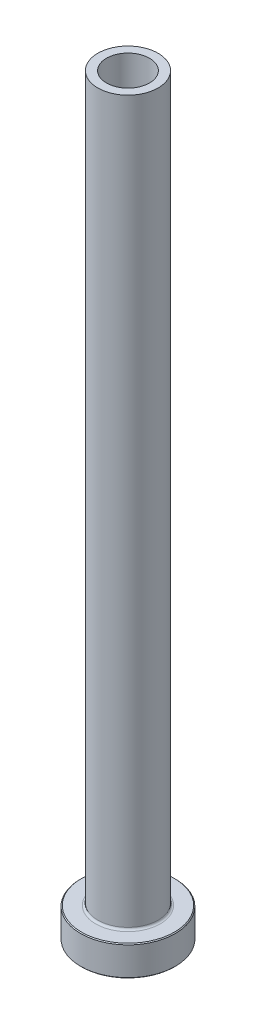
ISO-10303-21;
HEADER;
FILE_DESCRIPTION(('STEP AP214'),'2;1');
FILE_NAME('part.step','',(''),(''),'','','');
FILE_SCHEMA(('AUTOMOTIVE_DESIGN { 1 0 10303 214 1 1 1 1 }'));
ENDSEC;
DATA;
#1=APPLICATION_CONTEXT('core data for automotive mechanical design processes');
#2=APPLICATION_PROTOCOL_DEFINITION('international standard','automotive_design',2000,#1);
#3=PRODUCT_CONTEXT('',#1,'mechanical');
#4=PRODUCT('Part','Part','',(#3));
#5=PRODUCT_RELATED_PRODUCT_CATEGORY('part','',(#4));
#6=PRODUCT_DEFINITION_FORMATION('','',#4);
#7=PRODUCT_DEFINITION_CONTEXT('part definition',#1,'design');
#8=PRODUCT_DEFINITION('design','',#6,#7);
#9=PRODUCT_DEFINITION_SHAPE('','',#8);
#10=(LENGTH_UNIT() NAMED_UNIT(*) SI_UNIT(.MILLI.,.METRE.));
#11=(NAMED_UNIT(*) PLANE_ANGLE_UNIT() SI_UNIT($,.RADIAN.));
#12=(NAMED_UNIT(*) SI_UNIT($,.STERADIAN.) SOLID_ANGLE_UNIT());
#13=UNCERTAINTY_MEASURE_WITH_UNIT(LENGTH_MEASURE(1.E-05),#10,'distance_accuracy_value','');
#14=(GEOMETRIC_REPRESENTATION_CONTEXT(3) GLOBAL_UNCERTAINTY_ASSIGNED_CONTEXT((#13)) GLOBAL_UNIT_ASSIGNED_CONTEXT((#10,
#11,#12)) REPRESENTATION_CONTEXT('',''));
#15=CARTESIAN_POINT('',(0.,0.,0.));
#16=DIRECTION('',(0.,0.,1.));
#17=DIRECTION('',(1.,0.,0.));
#18=AXIS2_PLACEMENT_3D('',#15,#16,#17);
#19=CARTESIAN_POINT('',(0.,92.1876809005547,0.));
#20=DIRECTION('',(0.,1.,0.));
#21=DIRECTION('',(0.,0.,1.));
#22=AXIS2_PLACEMENT_3D('',#19,#20,#21);
#23=CYLINDRICAL_SURFACE('',#22,5.);
#24=CARTESIAN_POINT('',(0.,175.,0.));
#25=DIRECTION('',(0.,1.,0.));
#26=DIRECTION('',(0.,0.,1.));
#27=AXIS2_PLACEMENT_3D('',#24,#25,#26);
#28=CIRCLE('',#27,5.);
#29=CARTESIAN_POINT('',(0.,175.,5.));
#30=VERTEX_POINT('',#29);
#31=EDGE_CURVE('E62',#30,#30,#28,.T.);
#32=ORIENTED_EDGE('',*,*,#31,.T.);
#33=EDGE_LOOP('',(#32));
#34=FACE_BOUND('',#33,.T.);
#35=CARTESIAN_POINT('',(0.,130.,0.));
#36=DIRECTION('',(0.,1.,0.));
#37=DIRECTION('',(0.,0.,1.));
#38=AXIS2_PLACEMENT_3D('',#35,#36,#37);
#39=CIRCLE('',#38,5.);
#40=CARTESIAN_POINT('',(0.,130.,5.));
#41=VERTEX_POINT('',#40);
#42=EDGE_CURVE('E71',#41,#41,#39,.T.);
#43=ORIENTED_EDGE('',*,*,#42,.F.);
#44=EDGE_LOOP('',(#43));
#45=FACE_BOUND('',#44,.T.);
#46=ADVANCED_FACE('F30',(#34,#45),#23,.F.);
#47=CARTESIAN_POINT('',(-5.,175.,0.));
#48=DIRECTION('',(0.,1.,0.));
#49=DIRECTION('',(0.,0.,1.));
#50=AXIS2_PLACEMENT_3D('',#47,#48,#49);
#51=PLANE('',#50);
#52=CARTESIAN_POINT('',(0.,175.,0.));
#53=DIRECTION('',(0.,1.,0.));
#54=DIRECTION('',(0.,0.,1.));
#55=AXIS2_PLACEMENT_3D('',#52,#53,#54);
#56=CIRCLE('',#55,7.00000000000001);
#57=CARTESIAN_POINT('',(0.,175.,7.00000000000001));
#58=VERTEX_POINT('',#57);
#59=EDGE_CURVE('E65',#58,#58,#56,.T.);
#60=ORIENTED_EDGE('',*,*,#59,.T.);
#61=EDGE_LOOP('',(#60));
#62=FACE_BOUND('',#61,.T.);
#63=ORIENTED_EDGE('',*,*,#31,.F.);
#64=EDGE_LOOP('',(#63));
#65=FACE_BOUND('',#64,.T.);
#66=ADVANCED_FACE('F79',(#62,#65),#51,.T.);
#67=CARTESIAN_POINT('',(0.,92.1876809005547,0.));
#68=DIRECTION('',(0.,1.,0.));
#69=DIRECTION('',(0.,0.,1.));
#70=AXIS2_PLACEMENT_3D('',#67,#68,#69);
#71=CYLINDRICAL_SURFACE('',#70,7.);
#72=CARTESIAN_POINT('',(0.,7.50000000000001,0.));
#73=DIRECTION('',(0.,1.,0.));
#74=DIRECTION('',(0.,0.,1.));
#75=AXIS2_PLACEMENT_3D('',#72,#73,#74);
#76=CIRCLE('',#75,7.);
#77=CARTESIAN_POINT('',(0.,7.50000000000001,7.));
#78=VERTEX_POINT('',#77);
#79=EDGE_CURVE('E59',#78,#78,#76,.T.);
#80=ORIENTED_EDGE('',*,*,#79,.T.);
#81=EDGE_LOOP('',(#80));
#82=FACE_BOUND('',#81,.T.);
#83=ORIENTED_EDGE('',*,*,#59,.F.);
#84=EDGE_LOOP('',(#83));
#85=FACE_BOUND('',#84,.T.);
#86=ADVANCED_FACE('F85',(#82,#85),#71,.T.);
#87=CARTESIAN_POINT('',(-6.99999999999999,7.,0.));
#88=DIRECTION('',(0.,1.,0.));
#89=DIRECTION('',(0.,0.,1.));
#90=AXIS2_PLACEMENT_3D('',#87,#88,#89);
#91=PLANE('',#90);
#92=CARTESIAN_POINT('',(0.,7.,0.));
#93=DIRECTION('',(0.,1.,0.));
#94=DIRECTION('',(0.,0.,1.));
#95=AXIS2_PLACEMENT_3D('',#92,#93,#94);
#96=CIRCLE('',#95,10.8);
#97=CARTESIAN_POINT('',(0.,7.,10.8));
#98=VERTEX_POINT('',#97);
#99=EDGE_CURVE('E53',#98,#98,#96,.T.);
#100=ORIENTED_EDGE('',*,*,#99,.T.);
#101=EDGE_LOOP('',(#100));
#102=FACE_BOUND('',#101,.T.);
#103=CARTESIAN_POINT('',(0.,7.,0.));
#104=DIRECTION('',(0.,1.,0.));
#105=DIRECTION('',(0.,0.,1.));
#106=AXIS2_PLACEMENT_3D('',#103,#104,#105);
#107=CIRCLE('',#106,7.5);
#108=CARTESIAN_POINT('',(0.,7.,7.5));
#109=VERTEX_POINT('',#108);
#110=EDGE_CURVE('E56',#109,#109,#107,.F.);
#111=ORIENTED_EDGE('',*,*,#110,.T.);
#112=EDGE_LOOP('',(#111));
#113=FACE_BOUND('',#112,.T.);
#114=ADVANCED_FACE('F111',(#102,#113),#91,.T.);
#115=CARTESIAN_POINT('',(0.,92.1876809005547,0.));
#116=DIRECTION('',(0.,1.,0.));
#117=DIRECTION('',(0.,0.,1.));
#118=AXIS2_PLACEMENT_3D('',#115,#116,#117);
#119=CYLINDRICAL_SURFACE('',#118,11.);
#120=CARTESIAN_POINT('',(0.,6.8,0.));
#121=DIRECTION('',(0.,1.,0.));
#122=DIRECTION('',(0.,0.,1.));
#123=AXIS2_PLACEMENT_3D('',#120,#121,#122);
#124=CIRCLE('',#123,11.);
#125=CARTESIAN_POINT('',(0.,6.8,11.));
#126=VERTEX_POINT('',#125);
#127=EDGE_CURVE('E45',#126,#126,#124,.F.);
#128=ORIENTED_EDGE('',*,*,#127,.T.);
#129=EDGE_LOOP('',(#128));
#130=FACE_BOUND('',#129,.T.);
#131=CARTESIAN_POINT('',(0.,0.199999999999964,0.));
#132=DIRECTION('',(0.,-1.,0.));
#133=DIRECTION('',(0.,0.,-1.));
#134=AXIS2_PLACEMENT_3D('',#131,#132,#133);
#135=CIRCLE('',#134,11.);
#136=CARTESIAN_POINT('',(0.,0.199999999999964,-11.));
#137=VERTEX_POINT('',#136);
#138=EDGE_CURVE('E50',#137,#137,#135,.F.);
#139=ORIENTED_EDGE('',*,*,#138,.T.);
#140=EDGE_LOOP('',(#139));
#141=FACE_BOUND('',#140,.T.);
#142=ADVANCED_FACE('F108',(#130,#141),#119,.T.);
#143=CARTESIAN_POINT('',(-11.,0.,0.));
#144=DIRECTION('',(0.,-1.,0.));
#145=DIRECTION('',(0.,0.,-1.));
#146=AXIS2_PLACEMENT_3D('',#143,#144,#145);
#147=PLANE('',#146);
#148=CARTESIAN_POINT('',(0.,0.,0.));
#149=DIRECTION('',(0.,-1.,0.));
#150=DIRECTION('',(0.,0.,-1.));
#151=AXIS2_PLACEMENT_3D('',#148,#149,#150);
#152=CIRCLE('',#151,5.74999999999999);
#153=CARTESIAN_POINT('',(0.,0.,-5.74999999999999));
#154=VERTEX_POINT('',#153);
#155=EDGE_CURVE('E37',#154,#154,#152,.F.);
#156=ORIENTED_EDGE('',*,*,#155,.T.);
#157=EDGE_LOOP('',(#156));
#158=FACE_BOUND('',#157,.T.);
#159=CARTESIAN_POINT('',(0.,0.,0.));
#160=DIRECTION('',(0.,-1.,0.));
#161=DIRECTION('',(0.,0.,-1.));
#162=AXIS2_PLACEMENT_3D('',#159,#160,#161);
#163=CIRCLE('',#162,10.8);
#164=CARTESIAN_POINT('',(0.,0.,-10.8));
#165=VERTEX_POINT('',#164);
#166=EDGE_CURVE('E41',#165,#165,#163,.T.);
#167=ORIENTED_EDGE('',*,*,#166,.T.);
#168=EDGE_LOOP('',(#167));
#169=FACE_BOUND('',#168,.T.);
#170=ADVANCED_FACE('F110',(#158,#169),#147,.T.);
#171=CARTESIAN_POINT('',(0.,92.1876809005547,0.));
#172=DIRECTION('',(0.,1.,0.));
#173=DIRECTION('',(0.,0.,1.));
#174=AXIS2_PLACEMENT_3D('',#171,#172,#173);
#175=CYLINDRICAL_SURFACE('',#174,5.25);
#176=CARTESIAN_POINT('',(0.,0.499999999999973,0.));
#177=DIRECTION('',(0.,-1.,0.));
#178=DIRECTION('',(0.,0.,-1.));
#179=AXIS2_PLACEMENT_3D('',#176,#177,#178);
#180=CIRCLE('',#179,5.25);
#181=CARTESIAN_POINT('',(0.,0.499999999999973,-5.25));
#182=VERTEX_POINT('',#181);
#183=EDGE_CURVE('E10',#182,#182,#180,.T.);
#184=ORIENTED_EDGE('',*,*,#183,.T.);
#185=EDGE_LOOP('',(#184));
#186=FACE_BOUND('',#185,.T.);
#187=CARTESIAN_POINT('',(0.,118.,0.));
#188=DIRECTION('',(0.,1.,0.));
#189=DIRECTION('',(0.,0.,1.));
#190=AXIS2_PLACEMENT_3D('',#187,#188,#189);
#191=CIRCLE('',#190,5.25000000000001);
#192=CARTESIAN_POINT('',(0.,118.,5.25000000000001));
#193=VERTEX_POINT('',#192);
#194=EDGE_CURVE('E68',#193,#193,#191,.T.);
#195=ORIENTED_EDGE('',*,*,#194,.T.);
#196=EDGE_LOOP('',(#195));
#197=FACE_BOUND('',#196,.T.);
#198=ADVANCED_FACE('F118',(#186,#197),#175,.F.);
#199=CARTESIAN_POINT('',(0.,118.,0.));
#200=DIRECTION('',(0.,-1.,0.));
#201=DIRECTION('',(0.,0.,-1.));
#202=AXIS2_PLACEMENT_3D('',#199,#200,#201);
#203=CONICAL_SURFACE('',#202,5.25000000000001,0.0208303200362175);
#204=ORIENTED_EDGE('',*,*,#42,.T.);
#205=EDGE_LOOP('',(#204));
#206=FACE_BOUND('',#205,.T.);
#207=ORIENTED_EDGE('',*,*,#194,.F.);
#208=EDGE_LOOP('',(#207));
#209=FACE_BOUND('',#208,.T.);
#210=ADVANCED_FACE('F75',(#206,#209),#203,.F.);
#211=CARTESIAN_POINT('',(0.,7.50000000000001,0.));
#212=DIRECTION('',(0.,1.,0.));
#213=DIRECTION('',(0.,0.,1.));
#214=AXIS2_PLACEMENT_3D('',#211,#212,#213);
#215=TOROIDAL_SURFACE('',#214,7.5,0.5);
#216=ORIENTED_EDGE('',*,*,#110,.F.);
#217=EDGE_LOOP('',(#216));
#218=FACE_BOUND('',#217,.T.);
#219=ORIENTED_EDGE('',*,*,#79,.F.);
#220=EDGE_LOOP('',(#219));
#221=FACE_BOUND('',#220,.T.);
#222=ADVANCED_FACE('F90',(#218,#221),#215,.F.);
#223=CARTESIAN_POINT('',(0.,7.00000000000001,0.));
#224=DIRECTION('',(0.,-1.,0.));
#225=DIRECTION('',(0.,0.,-1.));
#226=AXIS2_PLACEMENT_3D('',#223,#224,#225);
#227=CONICAL_SURFACE('',#226,10.8,0.785398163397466);
#228=ORIENTED_EDGE('',*,*,#127,.F.);
#229=EDGE_LOOP('',(#228));
#230=FACE_BOUND('',#229,.T.);
#231=ORIENTED_EDGE('',*,*,#99,.F.);
#232=EDGE_LOOP('',(#231));
#233=FACE_BOUND('',#232,.T.);
#234=ADVANCED_FACE('F93',(#230,#233),#227,.T.);
#235=CARTESIAN_POINT('',(0.,0.199999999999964,0.));
#236=DIRECTION('',(0.,1.,0.));
#237=DIRECTION('',(0.,0.,1.));
#238=AXIS2_PLACEMENT_3D('',#235,#236,#237);
#239=CONICAL_SURFACE('',#238,11.,0.785398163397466);
#240=ORIENTED_EDGE('',*,*,#166,.F.);
#241=EDGE_LOOP('',(#240));
#242=FACE_BOUND('',#241,.T.);
#243=ORIENTED_EDGE('',*,*,#138,.F.);
#244=EDGE_LOOP('',(#243));
#245=FACE_BOUND('',#244,.T.);
#246=ADVANCED_FACE('F96',(#242,#245),#239,.T.);
#247=CARTESIAN_POINT('',(0.,0.,0.));
#248=DIRECTION('',(0.,-1.,0.));
#249=DIRECTION('',(0.,0.,-1.));
#250=AXIS2_PLACEMENT_3D('',#247,#248,#249);
#251=CONICAL_SURFACE('',#250,5.74999999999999,0.785398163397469);
#252=ORIENTED_EDGE('',*,*,#183,.F.);
#253=EDGE_LOOP('',(#252));
#254=FACE_BOUND('',#253,.T.);
#255=ORIENTED_EDGE('',*,*,#155,.F.);
#256=EDGE_LOOP('',(#255));
#257=FACE_BOUND('',#256,.T.);
#258=ADVANCED_FACE('F32',(#254,#257),#251,.F.);
#259=CLOSED_SHELL('',(#46,#66,#86,#114,#142,#170,#198,#210,#222,#234,#246,#258));
#260=MANIFOLD_SOLID_BREP('B2',#259);
#261=ADVANCED_BREP_SHAPE_REPRESENTATION('',(#18,#260),#14);
#262=SHAPE_DEFINITION_REPRESENTATION(#9,#261);
ENDSEC;
END-ISO-10303-21;
